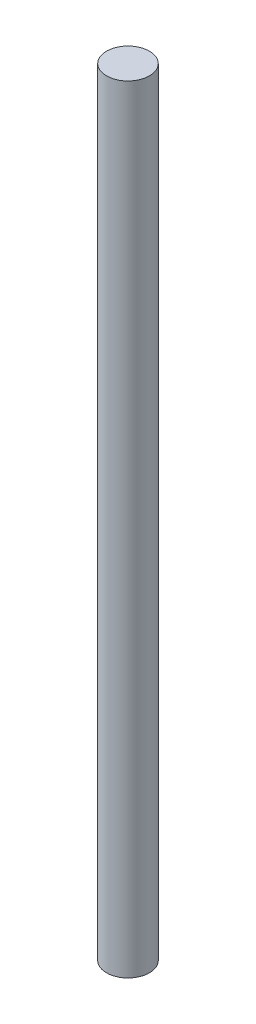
ISO-10303-21;
HEADER;
FILE_DESCRIPTION(('STEP AP214'),'2;1');
FILE_NAME('part.step','',(''),(''),'','','');
FILE_SCHEMA(('AUTOMOTIVE_DESIGN { 1 0 10303 214 1 1 1 1 }'));
ENDSEC;
DATA;
#1=APPLICATION_CONTEXT('core data for automotive mechanical design processes');
#2=APPLICATION_PROTOCOL_DEFINITION('international standard','automotive_design',2000,#1);
#3=PRODUCT_CONTEXT('',#1,'mechanical');
#4=PRODUCT('Part','Part','',(#3));
#5=PRODUCT_RELATED_PRODUCT_CATEGORY('part','',(#4));
#6=PRODUCT_DEFINITION_FORMATION('','',#4);
#7=PRODUCT_DEFINITION_CONTEXT('part definition',#1,'design');
#8=PRODUCT_DEFINITION('design','',#6,#7);
#9=PRODUCT_DEFINITION_SHAPE('','',#8);
#10=(LENGTH_UNIT() NAMED_UNIT(*) SI_UNIT(.MILLI.,.METRE.));
#11=(NAMED_UNIT(*) PLANE_ANGLE_UNIT() SI_UNIT($,.RADIAN.));
#12=(NAMED_UNIT(*) SI_UNIT($,.STERADIAN.) SOLID_ANGLE_UNIT());
#13=UNCERTAINTY_MEASURE_WITH_UNIT(LENGTH_MEASURE(1.E-05),#10,'distance_accuracy_value','');
#14=(GEOMETRIC_REPRESENTATION_CONTEXT(3) GLOBAL_UNCERTAINTY_ASSIGNED_CONTEXT((#13)) GLOBAL_UNIT_ASSIGNED_CONTEXT((#10,
#11,#12)) REPRESENTATION_CONTEXT('',''));
#15=CARTESIAN_POINT('',(0.,0.,0.));
#16=DIRECTION('',(0.,0.,1.));
#17=DIRECTION('',(1.,0.,0.));
#18=AXIS2_PLACEMENT_3D('',#15,#16,#17);
#19=CARTESIAN_POINT('',(0.,72.5,0.));
#20=DIRECTION('',(0.,-1.,0.));
#21=DIRECTION('',(0.,0.,-1.));
#22=AXIS2_PLACEMENT_3D('',#19,#20,#21);
#23=CYLINDRICAL_SURFACE('',#22,4.);
#24=CARTESIAN_POINT('',(0.,72.5,0.));
#25=DIRECTION('',(0.,1.,0.));
#26=DIRECTION('',(0.,0.,1.));
#27=AXIS2_PLACEMENT_3D('',#24,#25,#26);
#28=CIRCLE('',#27,4.);
#29=CARTESIAN_POINT('',(0.,72.5,4.));
#30=VERTEX_POINT('',#29);
#31=EDGE_CURVE('E10',#30,#30,#28,.T.);
#32=ORIENTED_EDGE('',*,*,#31,.F.);
#33=EDGE_LOOP('',(#32));
#34=FACE_BOUND('',#33,.T.);
#35=CARTESIAN_POINT('',(0.,-72.5,0.));
#36=DIRECTION('',(0.,1.,0.));
#37=DIRECTION('',(0.,0.,1.));
#38=AXIS2_PLACEMENT_3D('',#35,#36,#37);
#39=CIRCLE('',#38,4.);
#40=CARTESIAN_POINT('',(0.,-72.5,4.));
#41=VERTEX_POINT('',#40);
#42=EDGE_CURVE('E42',#41,#41,#39,.T.);
#43=ORIENTED_EDGE('',*,*,#42,.T.);
#44=EDGE_LOOP('',(#43));
#45=FACE_BOUND('',#44,.T.);
#46=ADVANCED_FACE('F39',(#34,#45),#23,.T.);
#47=CARTESIAN_POINT('',(0.,72.5,0.));
#48=DIRECTION('',(0.,1.,0.));
#49=DIRECTION('',(0.,0.,1.));
#50=AXIS2_PLACEMENT_3D('',#47,#48,#49);
#51=PLANE('',#50);
#52=ORIENTED_EDGE('',*,*,#31,.T.);
#53=EDGE_LOOP('',(#52));
#54=FACE_BOUND('',#53,.T.);
#55=ADVANCED_FACE('F54',(#54),#51,.T.);
#56=CARTESIAN_POINT('',(0.,-72.5,0.));
#57=DIRECTION('',(0.,1.,0.));
#58=DIRECTION('',(0.,0.,1.));
#59=AXIS2_PLACEMENT_3D('',#56,#57,#58);
#60=PLANE('',#59);
#61=ORIENTED_EDGE('',*,*,#42,.F.);
#62=EDGE_LOOP('',(#61));
#63=FACE_BOUND('',#62,.T.);
#64=ADVANCED_FACE('F52',(#63),#60,.F.);
#65=CLOSED_SHELL('',(#46,#55,#64));
#66=MANIFOLD_SOLID_BREP('B2',#65);
#67=ADVANCED_BREP_SHAPE_REPRESENTATION('',(#18,#66),#14);
#68=SHAPE_DEFINITION_REPRESENTATION(#9,#67);
ENDSEC;
END-ISO-10303-21;
